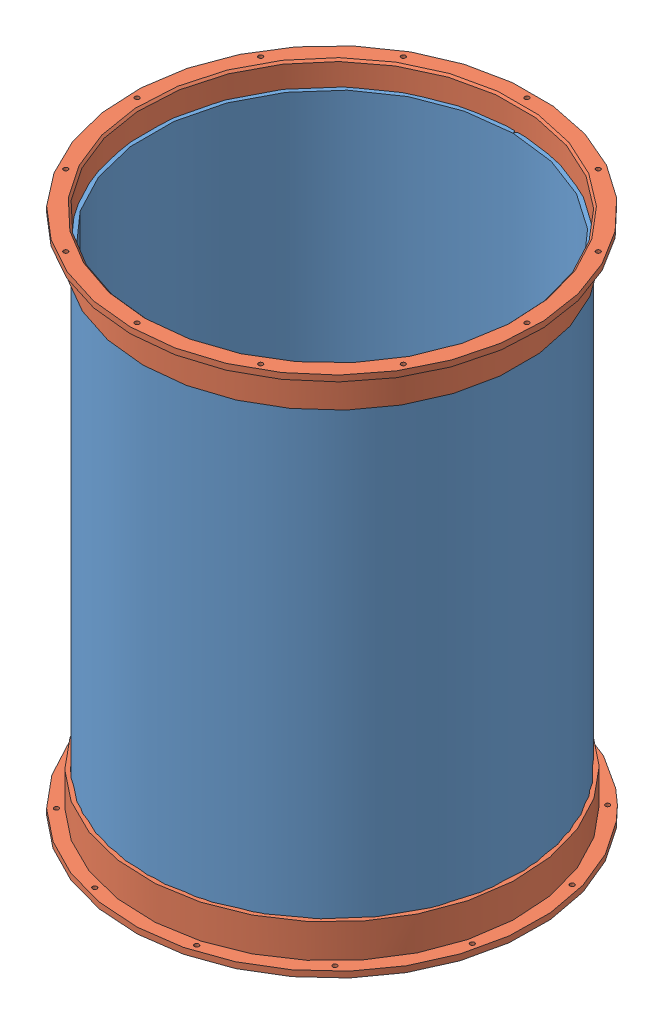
SolidWorks assembly SHALLOW WATER HOUSING.SLDASM, configuration Default (file format 4100). Lengths in mm.
Overall size (915.94 838.2 915.94).
3 component instances, 2 part files, 4 mates.
Components (placement in the parent):
- MAIN TUBE-1: MAIN TUBE.SLDPRT [Default] at (-54.6402 279.3775 -160.9721) size (593.72 762 593.71)
- MAIN RING-1: MAIN RING.SLDPRT [Default] at (-54.6402 317.4775 -160.9721) size (647.7 63.5 647.7)
- MAIN RING-2: MAIN RING.SLDPRT [Default] at (-54.6402 -520.7225 -160.9721) x (-0.714522 0 -0.699613) z (-0.699613 0 0.714522) size (647.7 63.5 647.7)
Mates (geometry in assembly coordinates):
- Concentric1: concentric aligned: cylinder of MAIN TUBE-1 through (-54.6402 -482.6225 -160.9721) axis (0 1 0) radius 296.8625; cylinder of MAIN RING-1 through (-54.6402 253.9775 -160.9721) axis (0 1 0) radius 296.9895
- Distance1: distance = 38.1 mm aligned: plane of MAIN TUBE-1 through (-54.6402 279.3775 -160.9721) normal (0 1 0); plane of MAIN RING-1 through (-54.6402 317.4775 -160.9721) normal (0 1 0)
- Concentric2: concentric anti-aligned: cylinder of MAIN TUBE-1 through (-54.6402 -482.6225 -160.9721) axis (0 1 0) radius 296.8625; cylinder of MAIN RING-2 through (-54.6402 -457.2225 -160.9721) axis (0 -1 0) radius 296.9895
- Distance2: distance = 38.1 mm aligned: plane of MAIN TUBE-1 through (-54.6402 -482.6225 -160.9721) normal (0 -1 0); plane of MAIN RING-2
